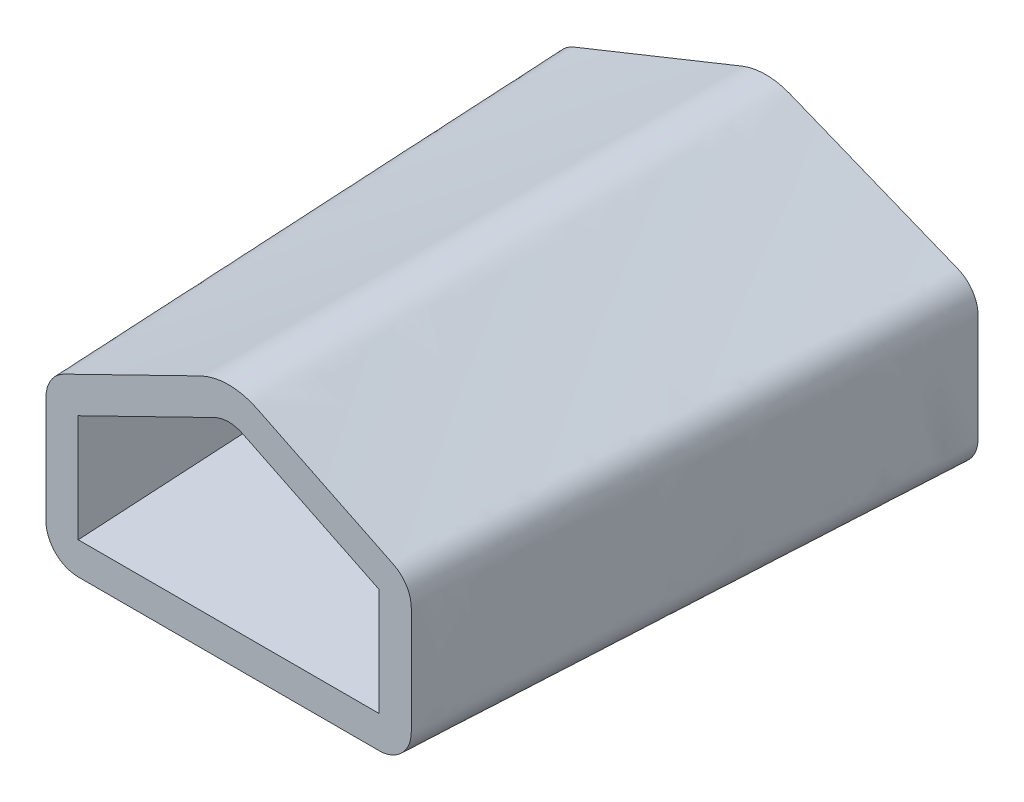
ISO-10303-21;
HEADER;
FILE_DESCRIPTION(('STEP AP214'),'2;1');
FILE_NAME('part.step','',(''),(''),'','','');
FILE_SCHEMA(('AUTOMOTIVE_DESIGN { 1 0 10303 214 1 1 1 1 }'));
ENDSEC;
DATA;
#1=APPLICATION_CONTEXT('core data for automotive mechanical design processes');
#2=APPLICATION_PROTOCOL_DEFINITION('international standard','automotive_design',2000,#1);
#3=PRODUCT_CONTEXT('',#1,'mechanical');
#4=PRODUCT('Part','Part','',(#3));
#5=PRODUCT_RELATED_PRODUCT_CATEGORY('part','',(#4));
#6=PRODUCT_DEFINITION_FORMATION('','',#4);
#7=PRODUCT_DEFINITION_CONTEXT('part definition',#1,'design');
#8=PRODUCT_DEFINITION('design','',#6,#7);
#9=PRODUCT_DEFINITION_SHAPE('','',#8);
#10=(LENGTH_UNIT() NAMED_UNIT(*) SI_UNIT(.MILLI.,.METRE.));
#11=(NAMED_UNIT(*) PLANE_ANGLE_UNIT() SI_UNIT($,.RADIAN.));
#12=(NAMED_UNIT(*) SI_UNIT($,.STERADIAN.) SOLID_ANGLE_UNIT());
#13=UNCERTAINTY_MEASURE_WITH_UNIT(LENGTH_MEASURE(1.E-05),#10,'distance_accuracy_value','');
#14=(GEOMETRIC_REPRESENTATION_CONTEXT(3) GLOBAL_UNCERTAINTY_ASSIGNED_CONTEXT((#13)) GLOBAL_UNIT_ASSIGNED_CONTEXT((#10,
#11,#12)) REPRESENTATION_CONTEXT('',''));
#15=CARTESIAN_POINT('',(0.,0.,0.));
#16=DIRECTION('',(0.,0.,1.));
#17=DIRECTION('',(1.,0.,0.));
#18=AXIS2_PLACEMENT_3D('',#15,#16,#17);
#19=CARTESIAN_POINT('',(-2.8,-2.7,10.));
#20=DIRECTION('',(0.,0.,1.));
#21=DIRECTION('',(1.,0.,0.));
#22=AXIS2_PLACEMENT_3D('',#19,#20,#21);
#23=PLANE('',#22);
#24=DIRECTION('',(0.,1.,0.));
#25=VECTOR('',#24,1.);
#26=CARTESIAN_POINT('',(2.8,-0.7,10.));
#27=LINE('',#26,#25);
#28=CARTESIAN_POINT('',(2.8,-2.7,10.));
#29=VERTEX_POINT('',#28);
#30=CARTESIAN_POINT('',(2.8,-0.7,10.));
#31=VERTEX_POINT('',#30);
#32=EDGE_CURVE('E463',#29,#31,#27,.T.);
#33=ORIENTED_EDGE('',*,*,#32,.F.);
#34=DIRECTION('',(1.,0.,0.));
#35=VECTOR('',#34,1.);
#36=CARTESIAN_POINT('',(2.8,-2.7,10.));
#37=LINE('',#36,#35);
#38=CARTESIAN_POINT('',(-2.8,-2.7,10.));
#39=VERTEX_POINT('',#38);
#40=EDGE_CURVE('E899',#39,#29,#37,.T.);
#41=ORIENTED_EDGE('',*,*,#40,.F.);
#42=DIRECTION('',(0.,-1.,0.));
#43=VECTOR('',#42,1.);
#44=CARTESIAN_POINT('',(-2.8,-2.7,10.));
#45=LINE('',#44,#43);
#46=CARTESIAN_POINT('',(-2.8,-0.7,10.));
#47=VERTEX_POINT('',#46);
#48=EDGE_CURVE('E908',#47,#39,#45,.T.);
#49=ORIENTED_EDGE('',*,*,#48,.F.);
#50=DIRECTION('',(-0.89852734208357,-0.438917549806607,0.));
#51=VECTOR('',#50,1.);
#52=CARTESIAN_POINT('',(-2.8,-0.7,10.));
#53=LINE('',#52,#51);
#54=CARTESIAN_POINT('',(-0.263350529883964,0.539116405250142,10.));
#55=VERTEX_POINT('',#54);
#56=EDGE_CURVE('E495',#55,#47,#53,.T.);
#57=ORIENTED_EDGE('',*,*,#56,.F.);
#58=CARTESIAN_POINT('',(0.,0.,10.));
#59=DIRECTION('',(0.,0.,1.));
#60=DIRECTION('',(-1.,0.,0.));
#61=AXIS2_PLACEMENT_3D('',#58,#59,#60);
#62=CIRCLE('',#61,0.599999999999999);
#63=CARTESIAN_POINT('',(0.263350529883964,0.539116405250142,10.));
#64=VERTEX_POINT('',#63);
#65=EDGE_CURVE('E515',#64,#55,#62,.T.);
#66=ORIENTED_EDGE('',*,*,#65,.F.);
#67=DIRECTION('',(-0.89852734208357,0.438917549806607,0.));
#68=VECTOR('',#67,1.);
#69=CARTESIAN_POINT('',(0.263350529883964,0.539116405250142,10.));
#70=LINE('',#69,#68);
#71=EDGE_CURVE('E344',#31,#64,#70,.T.);
#72=ORIENTED_EDGE('',*,*,#71,.F.);
#73=EDGE_LOOP('',(#33,#41,#49,#57,#66,#72));
#74=FACE_BOUND('',#73,.T.);
#75=CARTESIAN_POINT('',(-2.8,-2.7,10.));
#76=DIRECTION('',(0.,0.,1.));
#77=DIRECTION('',(1.,0.,0.));
#78=AXIS2_PLACEMENT_3D('',#75,#76,#77);
#79=CIRCLE('',#78,0.600000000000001);
#80=CARTESIAN_POINT('',(-3.4,-2.7,10.));
#81=VERTEX_POINT('',#80);
#82=CARTESIAN_POINT('',(-2.80000000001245,-3.3,10.));
#83=VERTEX_POINT('',#82);
#84=EDGE_CURVE('E483',#81,#83,#79,.T.);
#85=ORIENTED_EDGE('',*,*,#84,.T.);
#86=DIRECTION('',(1.,0.,0.));
#87=VECTOR('',#86,1.);
#88=CARTESIAN_POINT('',(-2.8,-3.3,10.));
#89=LINE('',#88,#87);
#90=CARTESIAN_POINT('',(2.80000000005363,-3.3,10.));
#91=VERTEX_POINT('',#90);
#92=EDGE_CURVE('E486',#83,#91,#89,.T.);
#93=ORIENTED_EDGE('',*,*,#92,.T.);
#94=CARTESIAN_POINT('',(2.8,-2.7,10.));
#95=DIRECTION('',(0.,0.,1.));
#96=DIRECTION('',(1.,0.,0.));
#97=AXIS2_PLACEMENT_3D('',#94,#95,#96);
#98=CIRCLE('',#97,0.600000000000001);
#99=CARTESIAN_POINT('',(3.4,-2.69999999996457,10.));
#100=VERTEX_POINT('',#99);
#101=EDGE_CURVE('E820',#91,#100,#98,.T.);
#102=ORIENTED_EDGE('',*,*,#101,.T.);
#103=DIRECTION('',(0.,1.,0.));
#104=VECTOR('',#103,1.);
#105=CARTESIAN_POINT('',(3.4,-2.7,10.));
#106=LINE('',#105,#104);
#107=CARTESIAN_POINT('',(3.4,-0.699999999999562,10.));
#108=VERTEX_POINT('',#107);
#109=EDGE_CURVE('E811',#100,#108,#106,.T.);
#110=ORIENTED_EDGE('',*,*,#109,.T.);
#111=CARTESIAN_POINT('',(2.8,-0.7,10.));
#112=DIRECTION('',(0.,0.,1.));
#113=DIRECTION('',(1.,0.,0.));
#114=AXIS2_PLACEMENT_3D('',#111,#112,#113);
#115=CIRCLE('',#114,0.600000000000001);
#116=CARTESIAN_POINT('',(3.06335052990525,-0.160883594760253,10.));
#117=VERTEX_POINT('',#116);
#118=EDGE_CURVE('E802',#108,#117,#115,.T.);
#119=ORIENTED_EDGE('',*,*,#118,.T.);
#120=DIRECTION('',(-0.89852734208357,0.438917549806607,0.));
#121=VECTOR('',#120,1.);
#122=CARTESIAN_POINT('',(3.06335052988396,-0.160883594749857,10.));
#123=LINE('',#122,#121);
#124=CARTESIAN_POINT('',(0.526701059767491,1.0782328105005,10.));
#125=VERTEX_POINT('',#124);
#126=EDGE_CURVE('E793',#117,#125,#123,.T.);
#127=ORIENTED_EDGE('',*,*,#126,.T.);
#128=CARTESIAN_POINT('',(0.,0.,10.));
#129=DIRECTION('',(0.,0.,1.));
#130=DIRECTION('',(1.,0.,0.));
#131=AXIS2_PLACEMENT_3D('',#128,#129,#130);
#132=CIRCLE('',#131,1.2);
#133=CARTESIAN_POINT('',(-0.526701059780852,1.07823281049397,10.));
#134=VERTEX_POINT('',#133);
#135=EDGE_CURVE('E784',#125,#134,#132,.T.);
#136=ORIENTED_EDGE('',*,*,#135,.T.);
#137=DIRECTION('',(-0.89852734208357,-0.438917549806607,0.));
#138=VECTOR('',#137,1.);
#139=CARTESIAN_POINT('',(-0.526701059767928,1.07823281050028,10.));
#140=LINE('',#139,#138);
#141=CARTESIAN_POINT('',(-3.06335052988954,-0.160883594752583,10.));
#142=VERTEX_POINT('',#141);
#143=EDGE_CURVE('E778',#134,#142,#140,.T.);
#144=ORIENTED_EDGE('',*,*,#143,.T.);
#145=CARTESIAN_POINT('',(-2.8,-0.7,10.));
#146=DIRECTION('',(0.,0.,1.));
#147=DIRECTION('',(1.,0.,0.));
#148=AXIS2_PLACEMENT_3D('',#145,#146,#147);
#149=CIRCLE('',#148,0.600000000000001);
#150=CARTESIAN_POINT('',(-3.4,-0.7,10.));
#151=VERTEX_POINT('',#150);
#152=EDGE_CURVE('E649',#142,#151,#149,.T.);
#153=ORIENTED_EDGE('',*,*,#152,.T.);
#154=DIRECTION('',(0.,-1.,0.));
#155=VECTOR('',#154,1.);
#156=CARTESIAN_POINT('',(-3.4,-0.7,10.));
#157=LINE('',#156,#155);
#158=EDGE_CURVE('E763',#151,#81,#157,.T.);
#159=ORIENTED_EDGE('',*,*,#158,.T.);
#160=EDGE_LOOP('',(#85,#93,#102,#110,#119,#127,#136,#144,#153,#159));
#161=FACE_BOUND('',#160,.T.);
#162=ADVANCED_FACE('F340',(#74,#161),#23,.T.);
#163=CARTESIAN_POINT('',(3.35,-0.7,0.));
#164=DIRECTION('',(0.,0.,1.));
#165=DIRECTION('',(1.,0.,0.));
#166=AXIS2_PLACEMENT_3D('',#163,#164,#165);
#167=PLANE('',#166);
#168=DIRECTION('',(1.,0.,0.));
#169=VECTOR('',#168,1.);
#170=CARTESIAN_POINT('',(3.35,-2.7,0.));
#171=LINE('',#170,#169);
#172=CARTESIAN_POINT('',(-3.35,-2.7,0.));
#173=VERTEX_POINT('',#172);
#174=CARTESIAN_POINT('',(3.35,-2.7,0.));
#175=VERTEX_POINT('',#174);
#176=EDGE_CURVE('E366',#173,#175,#171,.T.);
#177=ORIENTED_EDGE('',*,*,#176,.T.);
#178=DIRECTION('',(0.,1.,0.));
#179=VECTOR('',#178,1.);
#180=CARTESIAN_POINT('',(3.35,-0.7,0.));
#181=LINE('',#180,#179);
#182=CARTESIAN_POINT('',(3.35,-0.7,0.));
#183=VERTEX_POINT('',#182);
#184=EDGE_CURVE('E461',#175,#183,#181,.T.);
#185=ORIENTED_EDGE('',*,*,#184,.T.);
#186=DIRECTION('',(-0.92783887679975,0.372981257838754,0.));
#187=VECTOR('',#186,1.);
#188=CARTESIAN_POINT('',(0.223788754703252,0.55670332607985,0.));
#189=LINE('',#188,#187);
#190=CARTESIAN_POINT('',(0.22378875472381,0.556703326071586,0.));
#191=VERTEX_POINT('',#190);
#192=EDGE_CURVE('E469',#183,#191,#189,.T.);
#193=ORIENTED_EDGE('',*,*,#192,.T.);
#194=CARTESIAN_POINT('',(0.,0.,0.));
#195=DIRECTION('',(0.,0.,1.));
#196=DIRECTION('',(-1.,0.,0.));
#197=AXIS2_PLACEMENT_3D('',#194,#195,#196);
#198=CIRCLE('',#197,0.599999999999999);
#199=CARTESIAN_POINT('',(-0.223788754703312,0.556703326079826,0.));
#200=VERTEX_POINT('',#199);
#201=EDGE_CURVE('E473',#191,#200,#198,.T.);
#202=ORIENTED_EDGE('',*,*,#201,.T.);
#203=DIRECTION('',(-0.92783887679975,-0.372981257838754,0.));
#204=VECTOR('',#203,1.);
#205=CARTESIAN_POINT('',(-3.35,-0.7,0.));
#206=LINE('',#205,#204);
#207=CARTESIAN_POINT('',(-3.35,-0.7,0.));
#208=VERTEX_POINT('',#207);
#209=EDGE_CURVE('E511',#200,#208,#206,.T.);
#210=ORIENTED_EDGE('',*,*,#209,.T.);
#211=DIRECTION('',(0.,-1.,0.));
#212=VECTOR('',#211,1.);
#213=CARTESIAN_POINT('',(-3.35,-2.7,0.));
#214=LINE('',#213,#212);
#215=EDGE_CURVE('E518',#208,#173,#214,.T.);
#216=ORIENTED_EDGE('',*,*,#215,.T.);
#217=EDGE_LOOP('',(#177,#185,#193,#202,#210,#216));
#218=FACE_BOUND('',#217,.T.);
#219=CARTESIAN_POINT('',(3.35,-0.7,0.));
#220=DIRECTION('',(0.,0.,1.));
#221=DIRECTION('',(1.,0.,0.));
#222=AXIS2_PLACEMENT_3D('',#219,#220,#221);
#223=CIRCLE('',#222,0.600000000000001);
#224=CARTESIAN_POINT('',(3.95,-0.7,0.));
#225=VERTEX_POINT('',#224);
#226=CARTESIAN_POINT('',(3.57378875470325,-0.143296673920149,0.));
#227=VERTEX_POINT('',#226);
#228=EDGE_CURVE('E661',#225,#227,#223,.T.);
#229=ORIENTED_EDGE('',*,*,#228,.F.);
#230=DIRECTION('',(0.,1.,0.));
#231=VECTOR('',#230,1.);
#232=CARTESIAN_POINT('',(3.95,-2.7,0.));
#233=LINE('',#232,#231);
#234=CARTESIAN_POINT('',(3.95,-2.7,0.));
#235=VERTEX_POINT('',#234);
#236=EDGE_CURVE('E12',#235,#225,#233,.T.);
#237=ORIENTED_EDGE('',*,*,#236,.F.);
#238=CARTESIAN_POINT('',(3.35,-2.7,0.));
#239=DIRECTION('',(0.,0.,1.));
#240=DIRECTION('',(1.,0.,0.));
#241=AXIS2_PLACEMENT_3D('',#238,#239,#240);
#242=CIRCLE('',#241,0.600000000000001);
#243=CARTESIAN_POINT('',(3.35,-3.3,0.));
#244=VERTEX_POINT('',#243);
#245=EDGE_CURVE('E350',#244,#235,#242,.T.);
#246=ORIENTED_EDGE('',*,*,#245,.F.);
#247=DIRECTION('',(1.,0.,0.));
#248=VECTOR('',#247,1.);
#249=CARTESIAN_POINT('',(-3.35,-3.3,0.));
#250=LINE('',#249,#248);
#251=CARTESIAN_POINT('',(-3.35,-3.3,0.));
#252=VERTEX_POINT('',#251);
#253=EDGE_CURVE('E681',#252,#244,#250,.T.);
#254=ORIENTED_EDGE('',*,*,#253,.F.);
#255=CARTESIAN_POINT('',(-3.35,-2.7,0.));
#256=DIRECTION('',(0.,0.,1.));
#257=DIRECTION('',(1.,0.,0.));
#258=AXIS2_PLACEMENT_3D('',#255,#256,#257);
#259=CIRCLE('',#258,0.600000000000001);
#260=CARTESIAN_POINT('',(-3.95,-2.7,0.));
#261=VERTEX_POINT('',#260);
#262=EDGE_CURVE('E684',#261,#252,#259,.T.);
#263=ORIENTED_EDGE('',*,*,#262,.F.);
#264=DIRECTION('',(0.,-1.,0.));
#265=VECTOR('',#264,1.);
#266=CARTESIAN_POINT('',(-3.95,-0.7,0.));
#267=LINE('',#266,#265);
#268=CARTESIAN_POINT('',(-3.95,-0.7,0.));
#269=VERTEX_POINT('',#268);
#270=EDGE_CURVE('E702',#269,#261,#267,.T.);
#271=ORIENTED_EDGE('',*,*,#270,.F.);
#272=CARTESIAN_POINT('',(-3.35,-0.7,0.));
#273=DIRECTION('',(0.,0.,1.));
#274=DIRECTION('',(1.,0.,0.));
#275=AXIS2_PLACEMENT_3D('',#272,#273,#274);
#276=CIRCLE('',#275,0.600000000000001);
#277=CARTESIAN_POINT('',(-3.57378875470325,-0.143296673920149,0.));
#278=VERTEX_POINT('',#277);
#279=EDGE_CURVE('E705',#278,#269,#276,.T.);
#280=ORIENTED_EDGE('',*,*,#279,.F.);
#281=DIRECTION('',(-0.92783887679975,-0.372981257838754,0.));
#282=VECTOR('',#281,1.);
#283=CARTESIAN_POINT('',(-0.447577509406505,1.1134066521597,0.));
#284=LINE('',#283,#282);
#285=CARTESIAN_POINT('',(-0.447577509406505,1.1134066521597,0.));
#286=VERTEX_POINT('',#285);
#287=EDGE_CURVE('E723',#286,#278,#284,.T.);
#288=ORIENTED_EDGE('',*,*,#287,.F.);
#289=CARTESIAN_POINT('',(0.,0.,0.));
#290=DIRECTION('',(0.,0.,1.));
#291=DIRECTION('',(1.,0.,0.));
#292=AXIS2_PLACEMENT_3D('',#289,#290,#291);
#293=CIRCLE('',#292,1.2);
#294=CARTESIAN_POINT('',(0.447577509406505,1.1134066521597,0.));
#295=VERTEX_POINT('',#294);
#296=EDGE_CURVE('E726',#295,#286,#293,.T.);
#297=ORIENTED_EDGE('',*,*,#296,.F.);
#298=DIRECTION('',(-0.92783887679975,0.372981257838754,0.));
#299=VECTOR('',#298,1.);
#300=CARTESIAN_POINT('',(3.57378875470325,-0.143296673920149,0.));
#301=LINE('',#300,#299);
#302=EDGE_CURVE('E744',#227,#295,#301,.T.);
#303=ORIENTED_EDGE('',*,*,#302,.F.);
#304=EDGE_LOOP('',(#229,#237,#246,#254,#263,#271,#280,#288,#297,#303));
#305=FACE_BOUND('',#304,.T.);
#306=ADVANCED_FACE('F480',(#218,#305),#167,.F.);
#307=CARTESIAN_POINT('',(3.95,-2.69999999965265,0.));
#308=CARTESIAN_POINT('',(3.4,-2.69999999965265,10.));
#309=CARTESIAN_POINT('',(3.95,-2.53333333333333,0.));
#310=CARTESIAN_POINT('',(3.4,-2.53333333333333,10.));
#311=CARTESIAN_POINT('',(3.95000000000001,-2.20069753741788,0.));
#312=CARTESIAN_POINT('',(3.4,-2.19935746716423,10.));
#313=CARTESIAN_POINT('',(3.94999999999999,-1.70226473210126,0.));
#314=CARTESIAN_POINT('',(3.4,-1.69790979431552,10.));
#315=CARTESIAN_POINT('',(3.95000000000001,-1.20279902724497,0.));
#316=CARTESIAN_POINT('',(3.4,-1.19743748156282,10.));
#317=CARTESIAN_POINT('',(3.95,-0.868076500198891,0.));
#318=CARTESIAN_POINT('',(3.4,-0.865393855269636,10.));
#319=CARTESIAN_POINT('',(3.95,-0.641981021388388,0.));
#320=CARTESIAN_POINT('',(3.4,-0.642907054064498,10.));
#321=CARTESIAN_POINT('',(3.93309396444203,-0.525839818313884,0.));
#322=CARTESIAN_POINT('',(3.38354454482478,-0.528623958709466,9.99999999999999));
#323=CARTESIAN_POINT('',(3.858172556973,-0.36481034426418,0.));
#324=CARTESIAN_POINT('',(3.31218877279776,-0.372457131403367,10.));
#325=CARTESIAN_POINT('',(3.73765760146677,-0.23011532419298,0.));
#326=CARTESIAN_POINT('',(3.20229799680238,-0.244654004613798,9.99999999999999));
#327=CARTESIAN_POINT('',(3.63155324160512,-0.166517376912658,0.));
#328=CARTESIAN_POINT('',(3.11121220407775,-0.184263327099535,10.));
#329=CARTESIAN_POINT('',(3.31589527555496,-0.0396262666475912,0.));
#330=CARTESIAN_POINT('',(2.84966883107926,-0.0565031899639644,10.));
#331=CARTESIAN_POINT('',(2.79198032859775,0.170981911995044,0.));
#332=CARTESIAN_POINT('',(2.42920800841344,0.148885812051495,9.99999999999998));
#333=CARTESIAN_POINT('',(1.99644041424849,0.490780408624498,0.));
#334=CARTESIAN_POINT('',(1.80578419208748,0.453419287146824,10.));
#335=CARTESIAN_POINT('',(1.20800268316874,0.807723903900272,0.));
#336=CARTESIAN_POINT('',(1.17774515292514,0.760207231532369,9.99999999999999));
#337=CARTESIAN_POINT('',(0.697320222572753,1.01301276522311,0.));
#338=CARTESIAN_POINT('',(0.747508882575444,0.970371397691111,10.));
#339=CARTESIAN_POINT('',(0.365874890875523,1.14625022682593,0.));
#340=CARTESIAN_POINT('',(0.454464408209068,1.11351936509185,10.));
#341=CARTESIAN_POINT('',(0.215232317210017,1.18716510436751,0.));
#342=CARTESIAN_POINT('',(0.2912586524,1.17526575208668,10.));
#343=CARTESIAN_POINT('',(-7.49080916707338E-06,1.20645319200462,0.));
#344=CARTESIAN_POINT('',(9.93026597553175E-05,1.21249114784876,9.99999999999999));
#345=CARTESIAN_POINT('',(-0.215200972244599,1.18720163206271,0.));
#346=CARTESIAN_POINT('',(-0.29131410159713,1.17529230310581,10.));
#347=CARTESIAN_POINT('',(-0.365874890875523,1.14625022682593,0.));
#348=CARTESIAN_POINT('',(-0.454464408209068,1.11351936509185,10.));
#349=CARTESIAN_POINT('',(-0.697320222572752,1.01301276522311,0.));
#350=CARTESIAN_POINT('',(-0.747508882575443,0.970371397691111,10.));
#351=CARTESIAN_POINT('',(-1.20800268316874,0.80772390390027,0.));
#352=CARTESIAN_POINT('',(-1.17774515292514,0.76020723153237,10.));
#353=CARTESIAN_POINT('',(-1.99644041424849,0.490780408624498,0.));
#354=CARTESIAN_POINT('',(-1.80578419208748,0.453419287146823,10.));
#355=CARTESIAN_POINT('',(-2.79198032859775,0.170981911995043,0.));
#356=CARTESIAN_POINT('',(-2.42920800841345,0.148885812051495,10.));
#357=CARTESIAN_POINT('',(-3.31589527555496,-0.0396262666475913,0.));
#358=CARTESIAN_POINT('',(-2.84966883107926,-0.0565031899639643,10.));
#359=CARTESIAN_POINT('',(-3.63155324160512,-0.166517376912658,0.));
#360=CARTESIAN_POINT('',(-3.11121220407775,-0.184263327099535,10.));
#361=CARTESIAN_POINT('',(-3.73765760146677,-0.23011532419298,0.));
#362=CARTESIAN_POINT('',(-3.20231117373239,-0.244665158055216,10.));
#363=CARTESIAN_POINT('',(-3.858172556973,-0.364810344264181,0.));
#364=CARTESIAN_POINT('',(-3.31217507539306,-0.372442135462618,10.));
#365=CARTESIAN_POINT('',(-3.93309396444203,-0.525839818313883,0.));
#366=CARTESIAN_POINT('',(-3.38354585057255,-0.528616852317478,9.99999999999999));
#367=CARTESIAN_POINT('',(-3.95,-0.641981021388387,0.));
#368=CARTESIAN_POINT('',(-3.4,-0.642907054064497,10.));
#369=CARTESIAN_POINT('',(-3.95,-0.868076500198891,0.));
#370=CARTESIAN_POINT('',(-3.4,-0.865393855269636,10.));
#371=CARTESIAN_POINT('',(-3.95000000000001,-1.20279902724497,0.));
#372=CARTESIAN_POINT('',(-3.4,-1.19743748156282,9.99999999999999));
#373=CARTESIAN_POINT('',(-3.94999999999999,-1.70226473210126,0.));
#374=CARTESIAN_POINT('',(-3.40000000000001,-1.69790979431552,10.));
#375=CARTESIAN_POINT('',(-3.95,-2.20069753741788,0.));
#376=CARTESIAN_POINT('',(-3.4,-2.19935746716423,9.99999999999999));
#377=CARTESIAN_POINT('',(-3.95,-2.53333333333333,0.));
#378=CARTESIAN_POINT('',(-3.4,-2.53333333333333,10.));
#379=CARTESIAN_POINT('',(-3.95,-2.77853981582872,0.));
#380=CARTESIAN_POINT('',(-3.4,-2.77853981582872,10.));
#381=CARTESIAN_POINT('',(-3.91909996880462,-2.93256811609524,0.));
#382=CARTESIAN_POINT('',(-3.3684543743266,-2.93904365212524,10.));
#383=CARTESIAN_POINT('',(-3.79154434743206,-3.12790137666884,0.));
#384=CARTESIAN_POINT('',(-3.22815890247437,-3.14352125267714,9.99999999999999));
#385=CARTESIAN_POINT('',(-3.59713528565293,-3.26405577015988,0.));
#386=CARTESIAN_POINT('',(-3.02352070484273,-3.273168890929,10.));
#387=CARTESIAN_POINT('',(-3.43496688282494,-3.3,0.));
#388=CARTESIAN_POINT('',(-2.87273739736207,-3.3,10.));
#389=CARTESIAN_POINT('',(-2.79809373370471,-3.3,0.));
#390=CARTESIAN_POINT('',(-2.32753091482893,-3.3,10.));
#391=CARTESIAN_POINT('',(-1.68480682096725,-3.3,0.));
#392=CARTESIAN_POINT('',(-1.39145447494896,-3.30000000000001,10.));
#393=CARTESIAN_POINT('',(0.,-3.3,0.));
#394=CARTESIAN_POINT('',(0.,-3.29999999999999,10.));
#395=CARTESIAN_POINT('',(1.68480682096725,-3.3,0.));
#396=CARTESIAN_POINT('',(1.39145447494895,-3.30000000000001,10.));
#397=CARTESIAN_POINT('',(2.79809373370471,-3.3,0.));
#398=CARTESIAN_POINT('',(2.32753091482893,-3.3,10.));
#399=CARTESIAN_POINT('',(3.43496688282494,-3.3,0.));
#400=CARTESIAN_POINT('',(2.87273739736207,-3.3,10.));
#401=CARTESIAN_POINT('',(3.59713528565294,-3.26405577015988,0.));
#402=CARTESIAN_POINT('',(3.02352070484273,-3.273168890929,10.));
#403=CARTESIAN_POINT('',(3.79154434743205,-3.12790137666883,0.));
#404=CARTESIAN_POINT('',(3.22815890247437,-3.14352125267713,9.99999999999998));
#405=CARTESIAN_POINT('',(3.91909996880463,-2.93256811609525,0.));
#406=CARTESIAN_POINT('',(3.3684543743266,-2.93904365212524,10.));
#407=CARTESIAN_POINT('',(3.95,-2.77853981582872,0.));
#408=CARTESIAN_POINT('',(3.4,-2.77853981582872,10.));
#409=CARTESIAN_POINT('',(3.95,-2.69999999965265,0.));
#410=CARTESIAN_POINT('',(3.4,-2.69999999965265,10.));
#411=B_SPLINE_SURFACE_WITH_KNOTS('',3,1,((#307,#308),(#309,#310),(#311,#312),(#313,#314),(#315,
#316),(#317,#318),(#319,#320),(#321,#322),(#323,#324),(#325,#326),(#327,#328),(#329,#330),(#331,
#332),(#333,#334),(#335,#336),(#337,#338),(#339,#340),(#341,#342),(#343,#344),(#345,#346),(#347,
#348),(#349,#350),(#351,#352),(#353,#354),(#355,#356),(#357,#358),(#359,#360),(#361,#362),(#363,
#364),(#365,#366),(#367,#368),(#369,#370),(#371,#372),(#373,#374),(#375,#376),(#377,#378),(#379,
#380),(#381,#382),(#383,#384),(#385,#386),(#387,#388),(#389,#390),(#391,#392),(#393,#394),(#395,
#396),(#397,#398),(#399,#400),(#401,#402),(#403,#404),(#405,#406),(#407,#408),(#409,#410)),
.UNSPECIFIED.,.T.,.F.,.F.,(4,1,1,1,2,1,1,1,2,1,1,1,2,1,1,1,2,1,1,1,2,1,1,1,2,1,1,1,2,1,1,1,2,1,
1,1,2,1,1,1,4),(2,2),(0.,0.0243183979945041,0.0486367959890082,0.0729551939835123,
0.0972735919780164,0.105668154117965,0.114062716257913,0.122457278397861,0.13085184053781,
0.168329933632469,0.205808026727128,0.243286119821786,0.280764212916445,0.293025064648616,
0.305285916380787,0.317546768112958,0.329807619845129,0.367285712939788,0.404763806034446,
0.442241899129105,0.479719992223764,0.488114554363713,0.496509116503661,0.504903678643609,
0.513298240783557,0.537616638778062,0.561935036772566,0.58625343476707,0.610571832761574,
0.622031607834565,0.633491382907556,0.644951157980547,0.656410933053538,0.730848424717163,
0.805285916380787,0.879723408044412,0.954160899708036,0.965620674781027,0.977080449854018,
0.988540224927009,1.),(0.,1.),.UNSPECIFIED.);
#412=CARTESIAN_POINT('',(0.,-3.3,0.));
#413=CARTESIAN_POINT('',(0.,-3.3,10.));
#414=CARTESIAN_POINT('',(0.561602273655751,-3.3,0.));
#415=CARTESIAN_POINT('',(0.46381815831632,-3.3,10.));
#416=CARTESIAN_POINT('',(1.68480682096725,-3.3,0.));
#417=CARTESIAN_POINT('',(1.39145447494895,-3.30000000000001,10.));
#418=CARTESIAN_POINT('',(2.79809373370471,-3.3,0.));
#419=CARTESIAN_POINT('',(2.32753091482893,-3.3,10.));
#420=CARTESIAN_POINT('',(3.43496688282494,-3.3,0.));
#421=CARTESIAN_POINT('',(2.87273739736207,-3.3,10.));
#422=CARTESIAN_POINT('',(3.59713528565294,-3.26405577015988,0.));
#423=CARTESIAN_POINT('',(3.02352070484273,-3.273168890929,10.));
#424=CARTESIAN_POINT('',(3.79154434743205,-3.12790137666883,0.));
#425=CARTESIAN_POINT('',(3.22815890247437,-3.14352125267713,9.99999999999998));
#426=CARTESIAN_POINT('',(3.91909996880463,-2.93256811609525,0.));
#427=CARTESIAN_POINT('',(3.3684543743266,-2.93904365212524,10.));
#428=CARTESIAN_POINT('',(3.95,-2.77853981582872,0.));
#429=CARTESIAN_POINT('',(3.4,-2.77853981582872,10.));
#430=CARTESIAN_POINT('',(3.95,-2.53333333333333,0.));
#431=CARTESIAN_POINT('',(3.4,-2.53333333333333,10.));
#432=CARTESIAN_POINT('',(3.95000000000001,-2.20069753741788,0.));
#433=CARTESIAN_POINT('',(3.4,-2.19935746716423,10.));
#434=CARTESIAN_POINT('',(3.94999999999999,-1.70226473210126,0.));
#435=CARTESIAN_POINT('',(3.4,-1.69790979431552,10.));
#436=CARTESIAN_POINT('',(3.95000000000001,-1.20279902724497,0.));
#437=CARTESIAN_POINT('',(3.4,-1.19743748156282,10.));
#438=CARTESIAN_POINT('',(3.95,-0.868076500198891,0.));
#439=CARTESIAN_POINT('',(3.4,-0.865393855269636,10.));
#440=CARTESIAN_POINT('',(3.95,-0.641981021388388,0.));
#441=CARTESIAN_POINT('',(3.4,-0.642907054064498,10.));
#442=CARTESIAN_POINT('',(3.93309396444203,-0.525839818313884,0.));
#443=CARTESIAN_POINT('',(3.38354454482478,-0.528623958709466,9.99999999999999));
#444=CARTESIAN_POINT('',(3.858172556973,-0.36481034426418,0.));
#445=CARTESIAN_POINT('',(3.31218877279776,-0.372457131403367,10.));
#446=CARTESIAN_POINT('',(3.73765760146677,-0.23011532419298,0.));
#447=CARTESIAN_POINT('',(3.20229799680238,-0.244654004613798,9.99999999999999));
#448=CARTESIAN_POINT('',(3.63155324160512,-0.166517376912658,0.));
#449=CARTESIAN_POINT('',(3.11121220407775,-0.184263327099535,10.));
#450=CARTESIAN_POINT('',(3.31589527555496,-0.0396262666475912,0.));
#451=CARTESIAN_POINT('',(2.84966883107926,-0.0565031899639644,10.));
#452=CARTESIAN_POINT('',(2.79198032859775,0.170981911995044,0.));
#453=CARTESIAN_POINT('',(2.42920800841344,0.148885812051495,9.99999999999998));
#454=CARTESIAN_POINT('',(1.99644041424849,0.490780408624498,0.));
#455=CARTESIAN_POINT('',(1.80578419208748,0.453419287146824,10.));
#456=CARTESIAN_POINT('',(1.20800268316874,0.807723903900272,0.));
#457=CARTESIAN_POINT('',(1.17774515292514,0.760207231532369,9.99999999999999));
#458=CARTESIAN_POINT('',(0.697320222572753,1.01301276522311,0.));
#459=CARTESIAN_POINT('',(0.747508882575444,0.970371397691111,10.));
#460=CARTESIAN_POINT('',(0.365874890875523,1.14625022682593,0.));
#461=CARTESIAN_POINT('',(0.454464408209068,1.11351936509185,10.));
#462=CARTESIAN_POINT('',(0.215232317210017,1.18716510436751,0.));
#463=CARTESIAN_POINT('',(0.2912586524,1.17526575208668,10.));
#464=CARTESIAN_POINT('',(-7.49080916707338E-06,1.20645319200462,0.));
#465=CARTESIAN_POINT('',(9.93026597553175E-05,1.21249114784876,9.99999999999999));
#466=CARTESIAN_POINT('',(-0.215200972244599,1.18720163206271,0.));
#467=CARTESIAN_POINT('',(-0.29131410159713,1.17529230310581,10.));
#468=CARTESIAN_POINT('',(-0.365874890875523,1.14625022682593,0.));
#469=CARTESIAN_POINT('',(-0.454464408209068,1.11351936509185,10.));
#470=CARTESIAN_POINT('',(-0.697320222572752,1.01301276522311,0.));
#471=CARTESIAN_POINT('',(-0.747508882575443,0.970371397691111,10.));
#472=CARTESIAN_POINT('',(-1.20800268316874,0.80772390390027,0.));
#473=CARTESIAN_POINT('',(-1.17774515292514,0.76020723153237,10.));
#474=CARTESIAN_POINT('',(-1.99644041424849,0.490780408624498,0.));
#475=CARTESIAN_POINT('',(-1.80578419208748,0.453419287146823,10.));
#476=CARTESIAN_POINT('',(-2.79198032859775,0.170981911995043,0.));
#477=CARTESIAN_POINT('',(-2.42920800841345,0.148885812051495,10.));
#478=CARTESIAN_POINT('',(-3.31589527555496,-0.0396262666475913,0.));
#479=CARTESIAN_POINT('',(-2.84966883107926,-0.0565031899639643,10.));
#480=CARTESIAN_POINT('',(-3.63155324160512,-0.166517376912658,0.));
#481=CARTESIAN_POINT('',(-3.11121220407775,-0.184263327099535,10.));
#482=CARTESIAN_POINT('',(-3.73765760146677,-0.23011532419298,0.));
#483=CARTESIAN_POINT('',(-3.20231117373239,-0.244665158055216,10.));
#484=CARTESIAN_POINT('',(-3.858172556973,-0.364810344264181,0.));
#485=CARTESIAN_POINT('',(-3.31217507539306,-0.372442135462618,10.));
#486=CARTESIAN_POINT('',(-3.93309396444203,-0.525839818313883,0.));
#487=CARTESIAN_POINT('',(-3.38354585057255,-0.528616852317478,9.99999999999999));
#488=CARTESIAN_POINT('',(-3.95,-0.641981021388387,0.));
#489=CARTESIAN_POINT('',(-3.4,-0.642907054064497,10.));
#490=CARTESIAN_POINT('',(-3.95,-0.868076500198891,0.));
#491=CARTESIAN_POINT('',(-3.4,-0.865393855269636,10.));
#492=CARTESIAN_POINT('',(-3.95000000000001,-1.20279902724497,0.));
#493=CARTESIAN_POINT('',(-3.4,-1.19743748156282,9.99999999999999));
#494=CARTESIAN_POINT('',(-3.94999999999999,-1.70226473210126,0.));
#495=CARTESIAN_POINT('',(-3.40000000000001,-1.69790979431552,10.));
#496=CARTESIAN_POINT('',(-3.95,-2.20069753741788,0.));
#497=CARTESIAN_POINT('',(-3.4,-2.19935746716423,9.99999999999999));
#498=CARTESIAN_POINT('',(-3.95,-2.53333333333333,0.));
#499=CARTESIAN_POINT('',(-3.4,-2.53333333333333,10.));
#500=CARTESIAN_POINT('',(-3.95,-2.77853981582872,0.));
#501=CARTESIAN_POINT('',(-3.4,-2.77853981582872,10.));
#502=CARTESIAN_POINT('',(-3.91909996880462,-2.93256811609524,0.));
#503=CARTESIAN_POINT('',(-3.3684543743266,-2.93904365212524,10.));
#504=CARTESIAN_POINT('',(-3.79154434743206,-3.12790137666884,0.));
#505=CARTESIAN_POINT('',(-3.22815890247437,-3.14352125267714,9.99999999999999));
#506=CARTESIAN_POINT('',(-3.59713528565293,-3.26405577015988,0.));
#507=CARTESIAN_POINT('',(-3.02352070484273,-3.273168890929,10.));
#508=CARTESIAN_POINT('',(-3.43496688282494,-3.3,0.));
#509=CARTESIAN_POINT('',(-2.87273739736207,-3.3,10.));
#510=CARTESIAN_POINT('',(-2.79809373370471,-3.3,0.));
#511=CARTESIAN_POINT('',(-2.32753091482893,-3.3,10.));
#512=CARTESIAN_POINT('',(-1.68480682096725,-3.3,0.));
#513=CARTESIAN_POINT('',(-1.39145447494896,-3.30000000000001,10.));
#514=CARTESIAN_POINT('',(-0.561602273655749,-3.3,0.));
#515=CARTESIAN_POINT('',(-0.463818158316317,-3.3,10.));
#516=CARTESIAN_POINT('',(0.,-3.3,0.));
#517=CARTESIAN_POINT('',(0.,-3.3,10.));
#518=B_SPLINE_SURFACE_WITH_KNOTS('',3,1,((#412,#413),(#414,#415),(#416,#417),(#418,#419),(#420,
#421),(#422,#423),(#424,#425),(#426,#427),(#428,#429),(#430,#431),(#432,#433),(#434,#435),(#436,
#437),(#438,#439),(#440,#441),(#442,#443),(#444,#445),(#446,#447),(#448,#449),(#450,#451),(#452,
#453),(#454,#455),(#456,#457),(#458,#459),(#460,#461),(#462,#463),(#464,#465),(#466,#467),(#468,
#469),(#470,#471),(#472,#473),(#474,#475),(#476,#477),(#478,#479),(#480,#481),(#482,#483),(#484,
#485),(#486,#487),(#488,#489),(#490,#491),(#492,#493),(#494,#495),(#496,#497),(#498,#499),(#500,
#501),(#502,#503),(#504,#505),(#506,#507),(#508,#509),(#510,#511),(#512,#513),(#514,#515),(#516,
#517)),.UNSPECIFIED.,.T.,.F.,.F.,(4,1,2,1,1,1,2,1,1,1,2,1,1,1,2,1,1,1,2,1,1,1,2,1,1,1,2,1,1,1,2,
1,1,1,2,1,1,1,2,1,4),(2,2),(0.805285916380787,0.879723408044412,0.954160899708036,
0.965620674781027,0.977080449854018,0.988540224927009,1.,1.0243183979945,1.04863679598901,
1.07295519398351,1.09727359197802,1.10566815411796,1.11406271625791,1.12245727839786,
1.13085184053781,1.16832993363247,1.20580802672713,1.24328611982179,1.28076421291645,
1.29302506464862,1.30528591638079,1.31754676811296,1.32980761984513,1.36728571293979,
1.40476380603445,1.44224189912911,1.47971999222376,1.48811455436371,1.49650911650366,
1.50490367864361,1.51329824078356,1.53761663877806,1.56193503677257,1.58625343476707,
1.61057183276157,1.62203160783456,1.63349138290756,1.64495115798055,1.65641093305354,
1.73084842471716,1.80528591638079),(0.,1.),.UNSPECIFIED.);
#519=ORIENTED_EDGE('',*,*,#236,.T.);
#520=ORIENTED_EDGE('',*,*,#228,.T.);
#521=ORIENTED_EDGE('',*,*,#302,.T.);
#522=ORIENTED_EDGE('',*,*,#296,.T.);
#523=ORIENTED_EDGE('',*,*,#287,.T.);
#524=ORIENTED_EDGE('',*,*,#279,.T.);
#525=ORIENTED_EDGE('',*,*,#270,.T.);
#526=ORIENTED_EDGE('',*,*,#262,.T.);
#527=ORIENTED_EDGE('',*,*,#253,.T.);
#528=ORIENTED_EDGE('',*,*,#245,.T.);
#529=EDGE_LOOP('',(#519,#520,#521,#522,#523,#524,#525,#526,#527,#528));
#530=FACE_BOUND('',#529,.T.);
#531=ORIENTED_EDGE('',*,*,#152,.F.);
#532=ORIENTED_EDGE('',*,*,#143,.F.);
#533=ORIENTED_EDGE('',*,*,#135,.F.);
#534=ORIENTED_EDGE('',*,*,#126,.F.);
#535=ORIENTED_EDGE('',*,*,#118,.F.);
#536=ORIENTED_EDGE('',*,*,#109,.F.);
#537=ORIENTED_EDGE('',*,*,#101,.F.);
#538=ORIENTED_EDGE('',*,*,#92,.F.);
#539=ORIENTED_EDGE('',*,*,#84,.F.);
#540=ORIENTED_EDGE('',*,*,#158,.F.);
#541=EDGE_LOOP('',(#531,#532,#533,#534,#535,#536,#537,#538,#539,#540));
#542=FACE_BOUND('',#541,.T.);
#543=ADVANCED_FACE('F533',(#530,#542),#518,.T.);
#544=CARTESIAN_POINT('',(3.35,-2.7,0.));
#545=DIRECTION('',(0.998490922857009,0.,0.0549170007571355));
#546=DIRECTION('',(0.,1.,0.));
#547=AXIS2_PLACEMENT_3D('',#544,#545,#546);
#548=PLANE('',#547);
#549=ORIENTED_EDGE('',*,*,#184,.F.);
#550=DIRECTION('',(0.0549170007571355,0.,-0.998490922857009));
#551=VECTOR('',#550,1.);
#552=CARTESIAN_POINT('',(3.075,-2.7,5.));
#553=LINE('',#552,#551);
#554=EDGE_CURVE('E466',#29,#175,#553,.T.);
#555=ORIENTED_EDGE('',*,*,#554,.F.);
#556=ORIENTED_EDGE('',*,*,#32,.T.);
#557=DIRECTION('',(-0.0549170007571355,0.,0.998490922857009));
#558=VECTOR('',#557,1.);
#559=CARTESIAN_POINT('',(3.075,-0.7,5.));
#560=LINE('',#559,#558);
#561=EDGE_CURVE('E456',#183,#31,#560,.T.);
#562=ORIENTED_EDGE('',*,*,#561,.F.);
#563=EDGE_LOOP('',(#549,#555,#556,#562));
#564=FACE_BOUND('',#563,.T.);
#565=ADVANCED_FACE('F458',(#564),#548,.F.);
#566=CARTESIAN_POINT('',(3.35,-0.7,0.));
#567=CARTESIAN_POINT('',(2.8,-0.7,10.));
#568=CARTESIAN_POINT('',(3.08948239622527,-0.595274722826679,0.));
#569=CARTESIAN_POINT('',(2.588612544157,-0.596740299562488,10.));
#570=CARTESIAN_POINT('',(2.56524377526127,-0.38453643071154,0.));
#571=CARTESIAN_POINT('',(2.16841232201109,-0.391478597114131,9.99999999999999));
#572=CARTESIAN_POINT('',(1.7764511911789,-0.067450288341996,0.));
#573=CARTESIAN_POINT('',(1.54001947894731,-0.0845178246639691,10.));
#574=CARTESIAN_POINT('',(0.992650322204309,0.247629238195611,0.));
#575=CARTESIAN_POINT('',(0.907906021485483,0.224260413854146,10.));
#576=CARTESIAN_POINT('',(0.478090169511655,0.454476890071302,0.));
#577=CARTESIAN_POINT('',(0.480049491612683,0.433262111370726,10.));
#578=CARTESIAN_POINT('',(0.182108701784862,0.573458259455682,0.));
#579=CARTESIAN_POINT('',(0.22783352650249,0.556465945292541,10.));
#580=CARTESIAN_POINT('',(0.106784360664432,0.593638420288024,0.));
#581=CARTESIAN_POINT('',(0.147049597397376,0.587294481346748,10.));
#582=CARTESIAN_POINT('',(0.,0.603225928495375,0.));
#583=CARTESIAN_POINT('',(6.86104272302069E-05,0.606426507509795,9.99999999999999));
#584=CARTESIAN_POINT('',(-0.106784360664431,0.593638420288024,0.));
#585=CARTESIAN_POINT('',(-0.147105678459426,0.587309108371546,10.));
#586=CARTESIAN_POINT('',(-0.182108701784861,0.573458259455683,0.));
#587=CARTESIAN_POINT('',(-0.22783352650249,0.556465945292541,10.));
#588=CARTESIAN_POINT('',(-0.478090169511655,0.454476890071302,0.));
#589=CARTESIAN_POINT('',(-0.480049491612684,0.433262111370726,10.));
#590=CARTESIAN_POINT('',(-0.992650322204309,0.247629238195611,0.));
#591=CARTESIAN_POINT('',(-0.907906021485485,0.224260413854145,9.99999999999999));
#592=CARTESIAN_POINT('',(-1.77645119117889,-0.0674502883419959,0.));
#593=CARTESIAN_POINT('',(-1.54001947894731,-0.0845178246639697,10.));
#594=CARTESIAN_POINT('',(-2.56524377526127,-0.384536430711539,0.));
#595=CARTESIAN_POINT('',(-2.1684123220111,-0.391478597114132,10.));
#596=CARTESIAN_POINT('',(-3.08948239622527,-0.595274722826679,0.));
#597=CARTESIAN_POINT('',(-2.588612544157,-0.596740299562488,10.));
#598=CARTESIAN_POINT('',(-3.35,-0.7,0.));
#599=CARTESIAN_POINT('',(-2.8,-0.7,10.));
#600=B_SPLINE_SURFACE_WITH_KNOTS('',3,1,((#566,#567),(#568,#569),(#570,#571),(#572,#573),(#574,
#575),(#576,#577),(#578,#579),(#580,#581),(#582,#583),(#584,#585),(#586,#587),(#588,#589),(#590,
#591),(#592,#593),(#594,#595),(#596,#597),(#598,#599)),.UNSPECIFIED.,.F.,.F.,.F.,(4,1,1,1,2,1,1,
1,2,1,1,1,4),(2,2),(0.,0.115532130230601,0.231064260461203,0.346596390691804,0.462128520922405,
0.481064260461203,0.5,0.518935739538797,0.537871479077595,0.653403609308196,0.768935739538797,
0.884467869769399,1.),(0.,1.),.UNSPECIFIED.);
#601=DIRECTION('',(0.0549170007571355,0.,0.998490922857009));
#602=VECTOR('',#601,1.);
#603=CARTESIAN_POINT('',(-3.075,-0.7,5.));
#604=LINE('',#603,#602);
#605=EDGE_CURVE('E358',#208,#47,#604,.T.);
#606=ORIENTED_EDGE('',*,*,#192,.F.);
#607=ORIENTED_EDGE('',*,*,#561,.T.);
#608=ORIENTED_EDGE('',*,*,#71,.T.);
#609=ORIENTED_EDGE('',*,*,#65,.T.);
#610=ORIENTED_EDGE('',*,*,#56,.T.);
#611=ORIENTED_EDGE('',*,*,#605,.F.);
#612=ORIENTED_EDGE('',*,*,#209,.F.);
#613=ORIENTED_EDGE('',*,*,#201,.F.);
#614=EDGE_LOOP('',(#606,#607,#608,#609,#610,#611,#612,#613));
#615=FACE_BOUND('',#614,.T.);
#616=ADVANCED_FACE('F471',(#615),#600,.F.);
#617=CARTESIAN_POINT('',(-3.35,-2.7,0.));
#618=DIRECTION('',(0.,-1.,0.));
#619=DIRECTION('',(1.,0.,0.));
#620=AXIS2_PLACEMENT_3D('',#617,#618,#619);
#621=PLANE('',#620);
#622=ORIENTED_EDGE('',*,*,#176,.F.);
#623=DIRECTION('',(0.0549170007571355,0.,0.998490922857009));
#624=VECTOR('',#623,1.);
#625=CARTESIAN_POINT('',(-3.075,-2.7,5.));
#626=LINE('',#625,#624);
#627=EDGE_CURVE('E901',#173,#39,#626,.T.);
#628=ORIENTED_EDGE('',*,*,#627,.T.);
#629=ORIENTED_EDGE('',*,*,#40,.T.);
#630=ORIENTED_EDGE('',*,*,#554,.T.);
#631=EDGE_LOOP('',(#622,#628,#629,#630));
#632=FACE_BOUND('',#631,.T.);
#633=ADVANCED_FACE('F911',(#632),#621,.F.);
#634=CARTESIAN_POINT('',(-3.35,-0.7,0.));
#635=DIRECTION('',(-0.998490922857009,0.,0.0549170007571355));
#636=DIRECTION('',(0.,-1.,0.));
#637=AXIS2_PLACEMENT_3D('',#634,#635,#636);
#638=PLANE('',#637);
#639=ORIENTED_EDGE('',*,*,#215,.F.);
#640=ORIENTED_EDGE('',*,*,#605,.T.);
#641=ORIENTED_EDGE('',*,*,#48,.T.);
#642=ORIENTED_EDGE('',*,*,#627,.F.);
#643=EDGE_LOOP('',(#639,#640,#641,#642));
#644=FACE_BOUND('',#643,.T.);
#645=ADVANCED_FACE('F969',(#644),#638,.F.);
#646=CLOSED_SHELL('',(#162,#306,#543,#565,#616,#633,#645));
#647=MANIFOLD_SOLID_BREP('B2',#646);
#648=ADVANCED_BREP_SHAPE_REPRESENTATION('',(#18,#647),#14);
#649=SHAPE_DEFINITION_REPRESENTATION(#9,#648);
ENDSEC;
END-ISO-10303-21;
